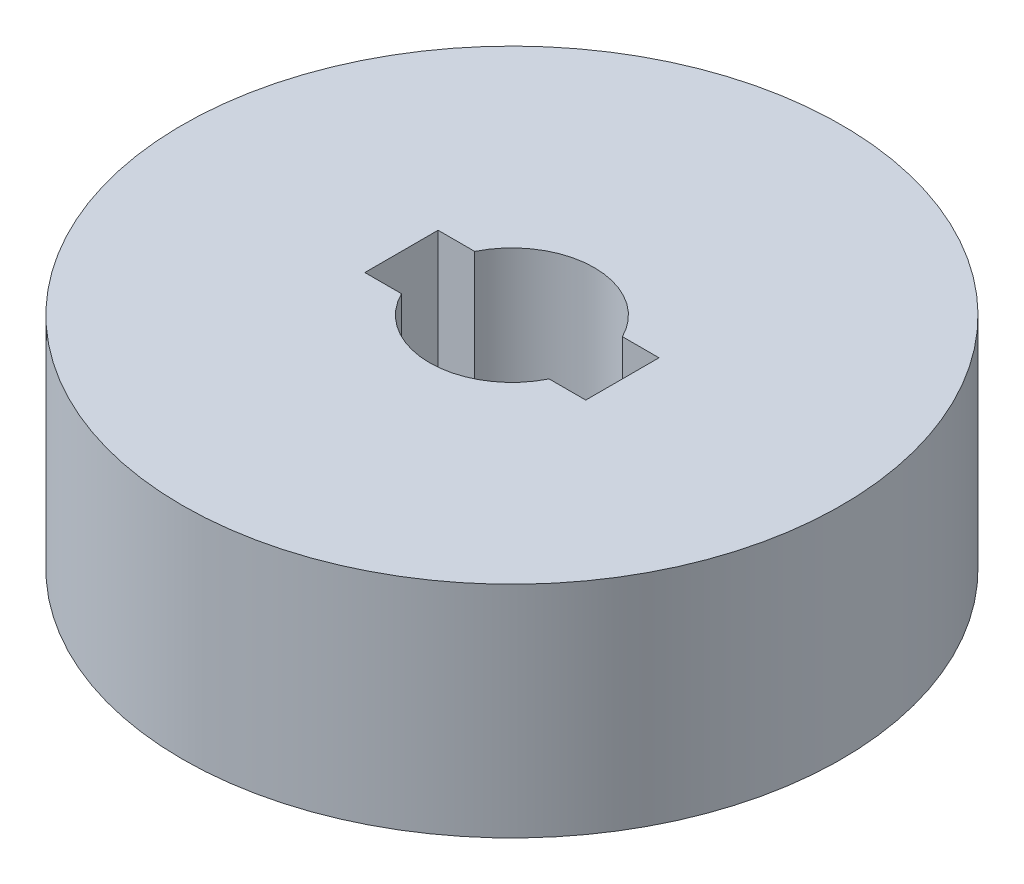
from build123d import *

# Parameters (mm, degrees)
EXTRUDE1_DEPTH          = 9.525
EXTRUDE1_DEPTH_BACK     = 9.525
SKETCH3_R               = 28.570682
CUT_EXTRUDE1_DEPTH      = 42.512568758
CUT_EXTRUDE1_DEPTH_BACK = 42.512568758


with BuildPart() as part:
    # Sketch3 → Extrude1 (new, two sides: drawn at the far end of the back side and taken through both)
    with BuildSketch(Plane(origin=(0, 0, 0), x_dir=(1, 0, 0), z_dir=(0, 1, 0)).offset(-EXTRUDE1_DEPTH_BACK)):
        with Locations(Location((0, 0, 0), (0, 0, 270))):
            Circle(SKETCH3_R)
    extrude(amount=EXTRUDE1_DEPTH + EXTRUDE1_DEPTH_BACK)

    # Sketch4 → Cut-Extrude1 (cut, two sides: drawn at the far end of the back side and taken through both)
    with BuildSketch(Plane(origin=(0, 0, 0), x_dir=(1, 0, 0), z_dir=(0, 1, 0)).offset(-CUT_EXTRUDE1_DEPTH_BACK)):
        with BuildLine():
            Line((6.399417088, 3.175), (9.574417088, 3.175))
            Line((9.574417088, 3.175), (9.574417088, -3.175))
            Line((9.574417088, -3.175), (6.399417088, -3.175))
            ThreePointArc((6.399417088, -3.175), (0, -7.14375), (-6.399417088, -3.175))
            Line((-6.399417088, -3.175), (-9.577182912, -3.175))
            Line((-9.577182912, -3.175), (-9.577182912, 3.175))
            Line((-9.577182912, 3.175), (-6.399417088, 3.175))
            ThreePointArc((-6.399417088, 3.175), (0, 7.14375), (6.399417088, 3.175))
        make_face()
    extrude(amount=CUT_EXTRUDE1_DEPTH + CUT_EXTRUDE1_DEPTH_BACK, mode=Mode.SUBTRACT)


solid = part.part
